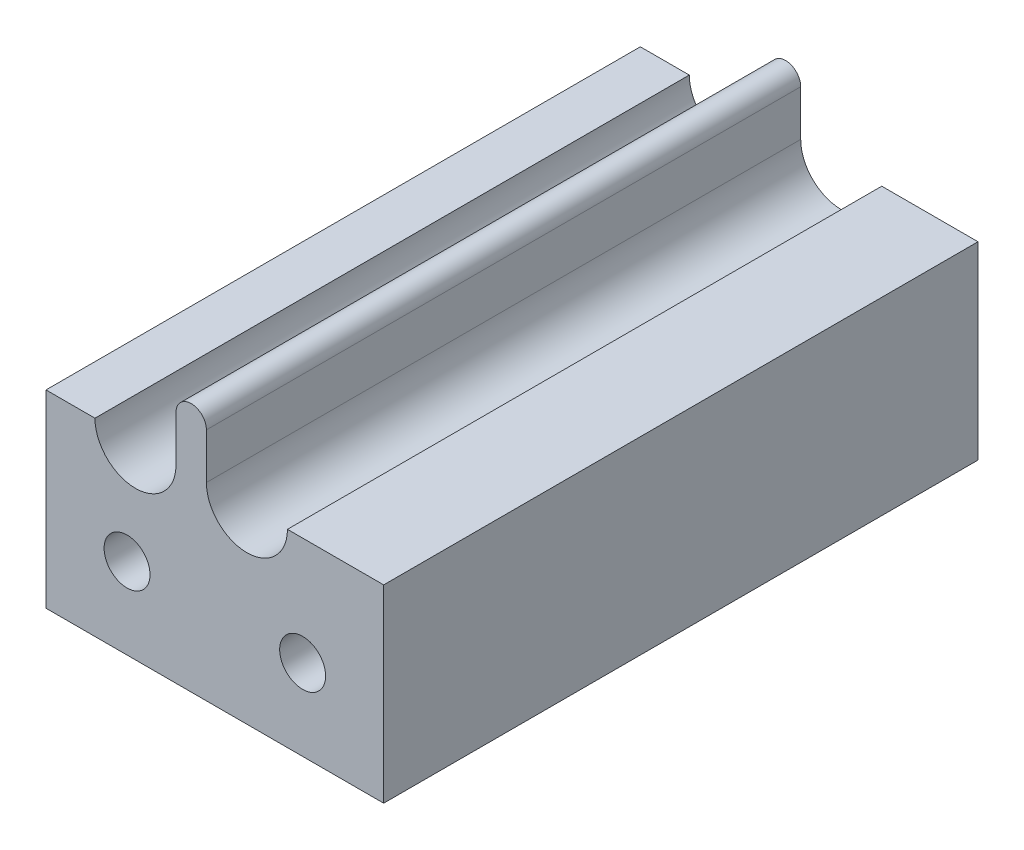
from build123d import *

# Parameters (mm, degrees)
BASE_EXTRUSION_DEPTH       = 88
TROU_TARAUD_M8X1_252_D     = 6.8
TROU_TARAUD_M8X1_252_DEPTH = 30
TROU_TARAUD_M8X1_252_TIP   = 2.042926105
EXTRUSION2_DEPTH           = 88


with BuildPart() as part:
    # Esquisse1 → Base-Extrusion (new body)
    with BuildSketch(Plane.XY):
        with BuildLine():
            Line((-299, -176.5), (-249, -176.5))
            Line((-249, -176.5), (-249, -148.5))
            Line((-249, -148.5), (-263.25, -148.5))
            ThreePointArc((-263.25, -148.5), (-269.25, -154.5), (-275.25, -148.5))
            Line((-275.25, -148.5), (-279.75, -148.5))
            ThreePointArc((-279.75, -148.5), (-285.75, -154.5), (-291.75, -148.5))
            Line((-291.75, -148.5), (-299, -148.5))
            Line((-299, -148.5), (-299, -176.5))
        make_face()
    extrude(amount=-BASE_EXTRUSION_DEPTH)

    # Trou taraud_ M8x1.252
    with Locations(Plane.XY):
        with Locations((-261, -164.5), (-287, -164.5)):
            Hole(TROU_TARAUD_M8X1_252_D / 2, depth=TROU_TARAUD_M8X1_252_DEPTH)
            with Locations((0, 0, -(TROU_TARAUD_M8X1_252_DEPTH + TROU_TARAUD_M8X1_252_TIP / 2))):  # 118° drill point
                Cone(0, TROU_TARAUD_M8X1_252_D / 2, TROU_TARAUD_M8X1_252_TIP, mode=Mode.SUBTRACT)

    # Esquisse6 → Extrusion2 (add)
    with BuildSketch(Plane.XY):
        with BuildLine():
            Line((-279.75, -148.5), (-275.25, -148.5))
            Line((-275.25, -148.5), (-275.25, -141.75))
            ThreePointArc((-275.25, -141.75), (-277.5, -139.5), (-279.75, -141.75))
            Line((-279.75, -141.75), (-279.75, -148.5))
        make_face()
    extrude(amount=-EXTRUSION2_DEPTH)


solid = part.part
